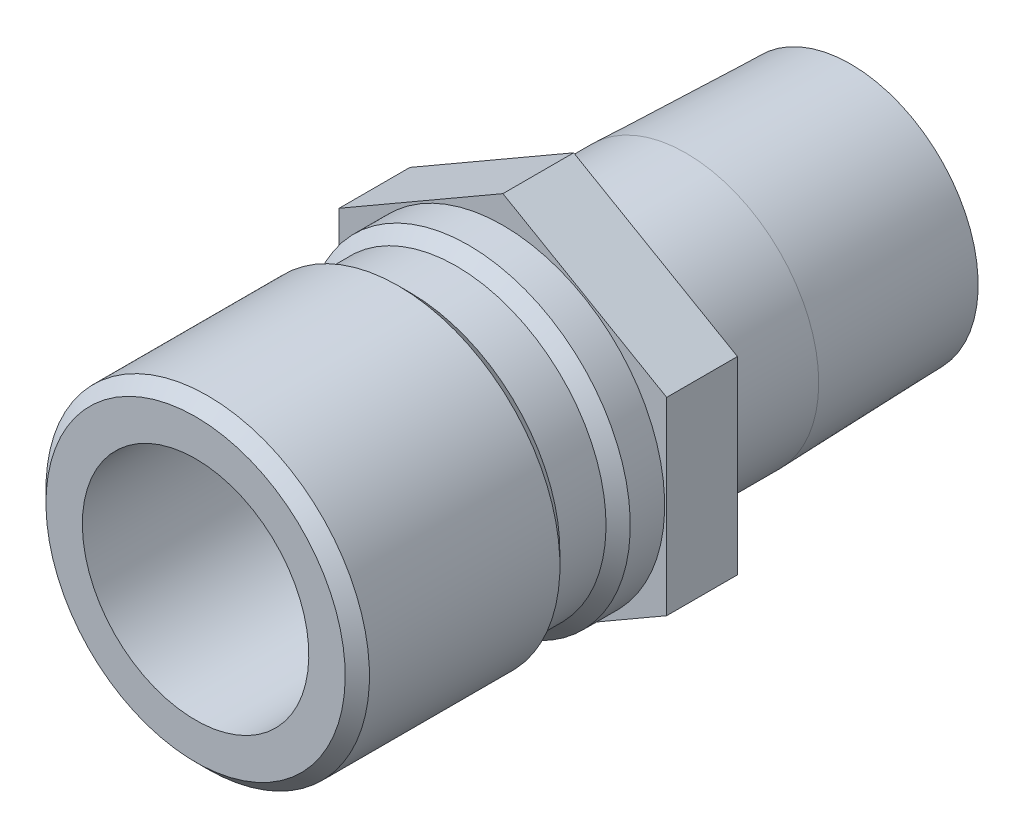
from build123d import *

# Parameters (mm, degrees)
SKETCH2_R           = 6.2611
BOSS_EXTRUDE1_DEPTH = 4.445


with BuildPart() as part:
    # Sketch1 → Revolve1 (revolve)
    with BuildSketch(Plane(origin=(0, 0, 0), x_dir=(0, 0, -1), z_dir=(1, 0, 0))):
        Polygon((-19.304, 7.112), (-19.304, 9.398), (-18.542, 10.16), (-6.5786, 10.16), (-5.8166, 9.398), (-2.921, 9.398), (-2.159, 10.16), (0, 10.16), (0, 8.3312), (11.5062, 8.3312), (21.844, 8.008145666), (21.844, 6.2611), (-1.071568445, 6.2611), (-1.524, 7.112), align=None)
    revolve(axis=Axis((0, 0, 0), (0, 0, 1)))

    # Sketch2 → Boss-Extrude1 (add)
    with BuildSketch(Plane.XY):
        Polygon((-10.287, 5.939202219), (-10.287, -5.939202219), (0, -11.878404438), (10.287, -5.939202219), (10.287, 5.939202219), (0, 11.878404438), align=None)
        with Locations(Location((0, 0, 0), (0, 0, 90))):
            Circle(SKETCH2_R, mode=Mode.SUBTRACT)
    extrude(amount=-BOSS_EXTRUDE1_DEPTH)


solid = part.part
